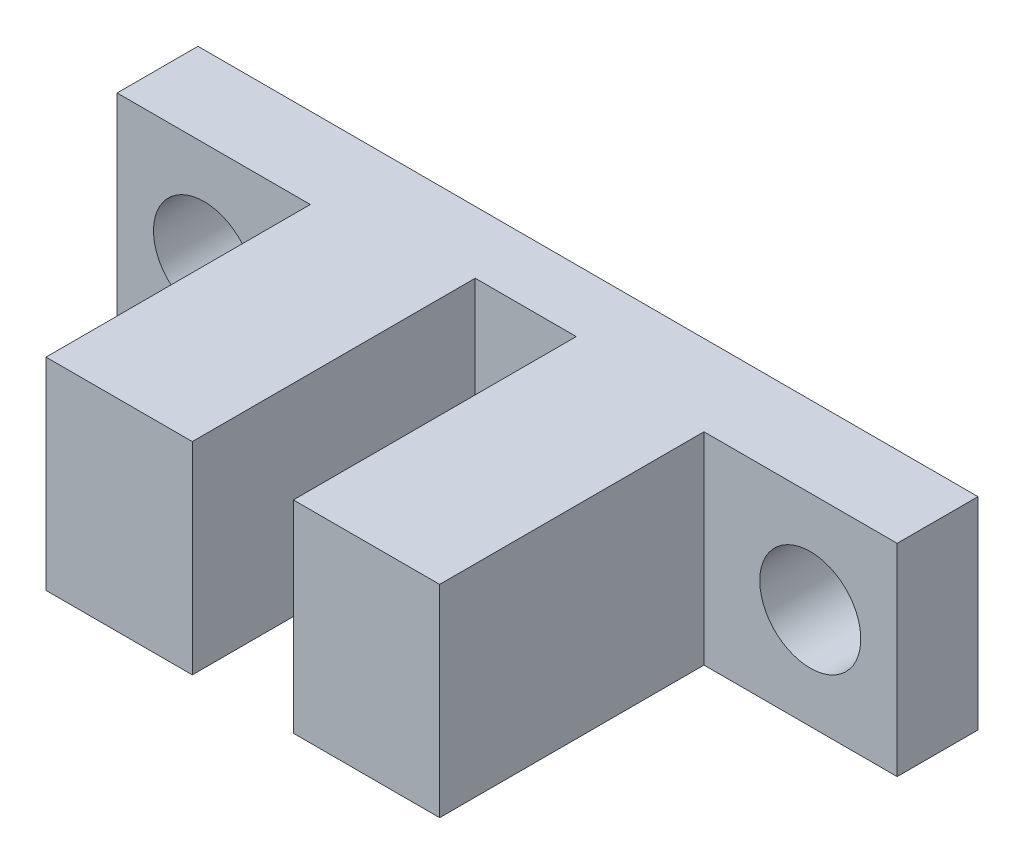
ISO-10303-21;
HEADER;
FILE_DESCRIPTION(('STEP AP214'),'2;1');
FILE_NAME('part.step','',(''),(''),'','','');
FILE_SCHEMA(('AUTOMOTIVE_DESIGN { 1 0 10303 214 1 1 1 1 }'));
ENDSEC;
DATA;
#1=APPLICATION_CONTEXT('core data for automotive mechanical design processes');
#2=APPLICATION_PROTOCOL_DEFINITION('international standard','automotive_design',2000,#1);
#3=PRODUCT_CONTEXT('',#1,'mechanical');
#4=PRODUCT('Part','Part','',(#3));
#5=PRODUCT_RELATED_PRODUCT_CATEGORY('part','',(#4));
#6=PRODUCT_DEFINITION_FORMATION('','',#4);
#7=PRODUCT_DEFINITION_CONTEXT('part definition',#1,'design');
#8=PRODUCT_DEFINITION('design','',#6,#7);
#9=PRODUCT_DEFINITION_SHAPE('','',#8);
#10=(LENGTH_UNIT() NAMED_UNIT(*) SI_UNIT(.MILLI.,.METRE.));
#11=(NAMED_UNIT(*) PLANE_ANGLE_UNIT() SI_UNIT($,.RADIAN.));
#12=(NAMED_UNIT(*) SI_UNIT($,.STERADIAN.) SOLID_ANGLE_UNIT());
#13=UNCERTAINTY_MEASURE_WITH_UNIT(LENGTH_MEASURE(1.E-05),#10,'distance_accuracy_value','');
#14=(GEOMETRIC_REPRESENTATION_CONTEXT(3) GLOBAL_UNCERTAINTY_ASSIGNED_CONTEXT((#13)) GLOBAL_UNIT_ASSIGNED_CONTEXT((#10,
#11,#12)) REPRESENTATION_CONTEXT('',''));
#15=CARTESIAN_POINT('',(0.,0.,0.));
#16=DIRECTION('',(0.,0.,1.));
#17=DIRECTION('',(1.,0.,0.));
#18=AXIS2_PLACEMENT_3D('',#15,#16,#17);
#19=CARTESIAN_POINT('',(0.,0.,10.8458));
#20=DIRECTION('',(0.,0.,-1.));
#21=DIRECTION('',(-1.,0.,0.));
#22=AXIS2_PLACEMENT_3D('',#19,#20,#21);
#23=PLANE('',#22);
#24=DIRECTION('',(-1.,0.,0.));
#25=VECTOR('',#24,1.);
#26=CARTESIAN_POINT('',(-6.1849,3.175,10.8458));
#27=LINE('',#26,#25);
#28=CARTESIAN_POINT('',(6.1849,3.175,10.8458));
#29=VERTEX_POINT('',#28);
#30=CARTESIAN_POINT('',(1.5875,3.175,10.8458));
#31=VERTEX_POINT('',#30);
#32=EDGE_CURVE('E166',#29,#31,#27,.T.);
#33=ORIENTED_EDGE('',*,*,#32,.T.);
#34=DIRECTION('',(0.,1.,0.));
#35=VECTOR('',#34,1.);
#36=CARTESIAN_POINT('',(1.5875,3.175,10.8458));
#37=LINE('',#36,#35);
#38=CARTESIAN_POINT('',(1.5875,-3.175,10.8458));
#39=VERTEX_POINT('',#38);
#40=EDGE_CURVE('E129',#39,#31,#37,.T.);
#41=ORIENTED_EDGE('',*,*,#40,.F.);
#42=DIRECTION('',(1.,0.,0.));
#43=VECTOR('',#42,1.);
#44=CARTESIAN_POINT('',(-6.1849,-3.175,10.8458));
#45=LINE('',#44,#43);
#46=CARTESIAN_POINT('',(6.1849,-3.175,10.8458));
#47=VERTEX_POINT('',#46);
#48=EDGE_CURVE('E170',#39,#47,#45,.T.);
#49=ORIENTED_EDGE('',*,*,#48,.T.);
#50=DIRECTION('',(0.,1.,0.));
#51=VECTOR('',#50,1.);
#52=CARTESIAN_POINT('',(6.1849,-3.175,10.8458));
#53=LINE('',#52,#51);
#54=EDGE_CURVE('E161',#47,#29,#53,.T.);
#55=ORIENTED_EDGE('',*,*,#54,.T.);
#56=EDGE_LOOP('',(#33,#41,#49,#55));
#57=FACE_BOUND('',#56,.T.);
#58=ADVANCED_FACE('F33',(#57),#23,.F.);
#59=CARTESIAN_POINT('',(0.,0.,2.54));
#60=DIRECTION('',(0.,0.,-1.));
#61=DIRECTION('',(-1.,0.,0.));
#62=AXIS2_PLACEMENT_3D('',#59,#60,#61);
#63=PLANE('',#62);
#64=CARTESIAN_POINT('',(9.525,0.,2.54));
#65=DIRECTION('',(0.,0.,-1.));
#66=DIRECTION('',(-1.,0.,0.));
#67=AXIS2_PLACEMENT_3D('',#64,#65,#66);
#68=CIRCLE('',#67,1.5875);
#69=CARTESIAN_POINT('',(7.9375,0.,2.54));
#70=VERTEX_POINT('',#69);
#71=EDGE_CURVE('E305',#70,#70,#68,.T.);
#72=ORIENTED_EDGE('',*,*,#71,.T.);
#73=EDGE_LOOP('',(#72));
#74=FACE_BOUND('',#73,.T.);
#75=DIRECTION('',(0.,1.,0.));
#76=VECTOR('',#75,1.);
#77=CARTESIAN_POINT('',(6.1849,-3.175,2.54));
#78=LINE('',#77,#76);
#79=CARTESIAN_POINT('',(6.1849,-3.175,2.54));
#80=VERTEX_POINT('',#79);
#81=CARTESIAN_POINT('',(6.1849,3.175,2.54));
#82=VERTEX_POINT('',#81);
#83=EDGE_CURVE('E58',#80,#82,#78,.T.);
#84=ORIENTED_EDGE('',*,*,#83,.F.);
#85=DIRECTION('',(1.,0.,0.));
#86=VECTOR('',#85,1.);
#87=CARTESIAN_POINT('',(-12.2555,-3.175,2.54));
#88=LINE('',#87,#86);
#89=CARTESIAN_POINT('',(12.2555,-3.175,2.54));
#90=VERTEX_POINT('',#89);
#91=EDGE_CURVE('E240',#80,#90,#88,.T.);
#92=ORIENTED_EDGE('',*,*,#91,.T.);
#93=DIRECTION('',(0.,1.,0.));
#94=VECTOR('',#93,1.);
#95=CARTESIAN_POINT('',(12.2555,-3.175,2.54));
#96=LINE('',#95,#94);
#97=CARTESIAN_POINT('',(12.2555,3.175,2.54));
#98=VERTEX_POINT('',#97);
#99=EDGE_CURVE('E223',#90,#98,#96,.T.);
#100=ORIENTED_EDGE('',*,*,#99,.T.);
#101=DIRECTION('',(-1.,0.,0.));
#102=VECTOR('',#101,1.);
#103=CARTESIAN_POINT('',(-12.2555,3.175,2.54));
#104=LINE('',#103,#102);
#105=EDGE_CURVE('E232',#98,#82,#104,.T.);
#106=ORIENTED_EDGE('',*,*,#105,.T.);
#107=EDGE_LOOP('',(#84,#92,#100,#106));
#108=FACE_BOUND('',#107,.T.);
#109=ADVANCED_FACE('F255',(#74,#108),#63,.F.);
#110=CARTESIAN_POINT('',(-9.525,0.,2.54));
#111=DIRECTION('',(0.,0.,-1.));
#112=DIRECTION('',(-1.,0.,0.));
#113=AXIS2_PLACEMENT_3D('',#110,#111,#112);
#114=CIRCLE('',#113,1.5875);
#115=CARTESIAN_POINT('',(-11.1125,0.,2.54));
#116=VERTEX_POINT('',#115);
#117=EDGE_CURVE('E153',#116,#116,#114,.T.);
#118=ORIENTED_EDGE('',*,*,#117,.T.);
#119=EDGE_LOOP('',(#118));
#120=FACE_BOUND('',#119,.T.);
#121=DIRECTION('',(0.,-1.,0.));
#122=VECTOR('',#121,1.);
#123=CARTESIAN_POINT('',(-6.1849,-3.175,2.54));
#124=LINE('',#123,#122);
#125=CARTESIAN_POINT('',(-6.1849,3.175,2.54));
#126=VERTEX_POINT('',#125);
#127=CARTESIAN_POINT('',(-6.1849,-3.175,2.54));
#128=VERTEX_POINT('',#127);
#129=EDGE_CURVE('E165',#126,#128,#124,.T.);
#130=ORIENTED_EDGE('',*,*,#129,.F.);
#131=CARTESIAN_POINT('',(-12.2555,3.175,2.54));
#132=VERTEX_POINT('',#131);
#133=EDGE_CURVE('E236',#126,#132,#104,.T.);
#134=ORIENTED_EDGE('',*,*,#133,.T.);
#135=DIRECTION('',(0.,-1.,0.));
#136=VECTOR('',#135,1.);
#137=CARTESIAN_POINT('',(-12.2555,-3.175,2.54));
#138=LINE('',#137,#136);
#139=CARTESIAN_POINT('',(-12.2555,-3.175,2.54));
#140=VERTEX_POINT('',#139);
#141=EDGE_CURVE('E235',#132,#140,#138,.T.);
#142=ORIENTED_EDGE('',*,*,#141,.T.);
#143=EDGE_CURVE('E227',#140,#128,#88,.T.);
#144=ORIENTED_EDGE('',*,*,#143,.T.);
#145=EDGE_LOOP('',(#130,#134,#142,#144));
#146=FACE_BOUND('',#145,.T.);
#147=ADVANCED_FACE('F247',(#120,#146),#63,.F.);
#148=CARTESIAN_POINT('',(12.2555,-3.175,2.54));
#149=DIRECTION('',(-1.,0.,0.));
#150=DIRECTION('',(0.,0.,1.));
#151=AXIS2_PLACEMENT_3D('',#148,#149,#150);
#152=PLANE('',#151);
#153=DIRECTION('',(0.,1.,0.));
#154=VECTOR('',#153,1.);
#155=CARTESIAN_POINT('',(12.2555,-3.175,0.));
#156=LINE('',#155,#154);
#157=CARTESIAN_POINT('',(12.2555,-3.175,0.));
#158=VERTEX_POINT('',#157);
#159=CARTESIAN_POINT('',(12.2555,3.175,0.));
#160=VERTEX_POINT('',#159);
#161=EDGE_CURVE('E205',#158,#160,#156,.T.);
#162=ORIENTED_EDGE('',*,*,#161,.T.);
#163=DIRECTION('',(0.,0.,-1.));
#164=VECTOR('',#163,1.);
#165=CARTESIAN_POINT('',(12.2555,3.175,2.54));
#166=LINE('',#165,#164);
#167=EDGE_CURVE('E11',#98,#160,#166,.T.);
#168=ORIENTED_EDGE('',*,*,#167,.F.);
#169=ORIENTED_EDGE('',*,*,#99,.F.);
#170=DIRECTION('',(0.,0.,-1.));
#171=VECTOR('',#170,1.);
#172=CARTESIAN_POINT('',(12.2555,-3.175,2.54));
#173=LINE('',#172,#171);
#174=EDGE_CURVE('E224',#90,#158,#173,.T.);
#175=ORIENTED_EDGE('',*,*,#174,.T.);
#176=EDGE_LOOP('',(#162,#168,#169,#175));
#177=FACE_BOUND('',#176,.T.);
#178=ADVANCED_FACE('F35',(#177),#152,.F.);
#179=CARTESIAN_POINT('',(-12.2555,3.175,2.54));
#180=DIRECTION('',(0.,-1.,0.));
#181=DIRECTION('',(0.,0.,-1.));
#182=AXIS2_PLACEMENT_3D('',#179,#180,#181);
#183=PLANE('',#182);
#184=DIRECTION('',(-1.,0.,0.));
#185=VECTOR('',#184,1.);
#186=CARTESIAN_POINT('',(-1.5875,3.175,1.9558));
#187=LINE('',#186,#185);
#188=CARTESIAN_POINT('',(1.5875,3.175,1.9558));
#189=VERTEX_POINT('',#188);
#190=CARTESIAN_POINT('',(-1.5875,3.175,1.9558));
#191=VERTEX_POINT('',#190);
#192=EDGE_CURVE('E139',#189,#191,#187,.T.);
#193=ORIENTED_EDGE('',*,*,#192,.F.);
#194=DIRECTION('',(0.,0.,1.));
#195=VECTOR('',#194,1.);
#196=CARTESIAN_POINT('',(1.5875,3.175,1.9558));
#197=LINE('',#196,#195);
#198=EDGE_CURVE('E123',#189,#31,#197,.T.);
#199=ORIENTED_EDGE('',*,*,#198,.T.);
#200=ORIENTED_EDGE('',*,*,#32,.F.);
#201=DIRECTION('',(0.,0.,-1.));
#202=VECTOR('',#201,1.);
#203=CARTESIAN_POINT('',(6.1849,3.175,10.8458));
#204=LINE('',#203,#202);
#205=EDGE_CURVE('E196',#29,#82,#204,.T.);
#206=ORIENTED_EDGE('',*,*,#205,.T.);
#207=ORIENTED_EDGE('',*,*,#105,.F.);
#208=ORIENTED_EDGE('',*,*,#167,.T.);
#209=DIRECTION('',(-1.,0.,0.));
#210=VECTOR('',#209,1.);
#211=CARTESIAN_POINT('',(-12.2555,3.175,0.));
#212=LINE('',#211,#210);
#213=CARTESIAN_POINT('',(-12.2555,3.175,0.));
#214=VERTEX_POINT('',#213);
#215=EDGE_CURVE('E208',#160,#214,#212,.T.);
#216=ORIENTED_EDGE('',*,*,#215,.T.);
#217=DIRECTION('',(0.,0.,-1.));
#218=VECTOR('',#217,1.);
#219=CARTESIAN_POINT('',(-12.2555,3.175,2.54));
#220=LINE('',#219,#218);
#221=EDGE_CURVE('E42',#132,#214,#220,.T.);
#222=ORIENTED_EDGE('',*,*,#221,.F.);
#223=ORIENTED_EDGE('',*,*,#133,.F.);
#224=DIRECTION('',(0.,0.,-1.));
#225=VECTOR('',#224,1.);
#226=CARTESIAN_POINT('',(-6.1849,3.175,10.8458));
#227=LINE('',#226,#225);
#228=CARTESIAN_POINT('',(-6.1849,3.175,10.8458));
#229=VERTEX_POINT('',#228);
#230=EDGE_CURVE('E189',#229,#126,#227,.T.);
#231=ORIENTED_EDGE('',*,*,#230,.F.);
#232=CARTESIAN_POINT('',(-1.5875,3.175,10.8458));
#233=VERTEX_POINT('',#232);
#234=EDGE_CURVE('E164',#233,#229,#27,.T.);
#235=ORIENTED_EDGE('',*,*,#234,.F.);
#236=DIRECTION('',(0.,0.,1.));
#237=VECTOR('',#236,1.);
#238=CARTESIAN_POINT('',(-1.5875,3.175,1.9558));
#239=LINE('',#238,#237);
#240=EDGE_CURVE('E50',#191,#233,#239,.T.);
#241=ORIENTED_EDGE('',*,*,#240,.F.);
#242=EDGE_LOOP('',(#193,#199,#200,#206,#207,#208,#216,#222,#223,#231,#235,#241));
#243=FACE_BOUND('',#242,.T.);
#244=ADVANCED_FACE('F144',(#243),#183,.F.);
#245=CARTESIAN_POINT('',(-12.2555,-3.175,2.54));
#246=DIRECTION('',(1.,0.,0.));
#247=DIRECTION('',(0.,0.,-1.));
#248=AXIS2_PLACEMENT_3D('',#245,#246,#247);
#249=PLANE('',#248);
#250=DIRECTION('',(0.,-1.,0.));
#251=VECTOR('',#250,1.);
#252=CARTESIAN_POINT('',(-12.2555,-3.175,0.));
#253=LINE('',#252,#251);
#254=CARTESIAN_POINT('',(-12.2555,-3.175,0.));
#255=VERTEX_POINT('',#254);
#256=EDGE_CURVE('E214',#214,#255,#253,.T.);
#257=ORIENTED_EDGE('',*,*,#256,.T.);
#258=DIRECTION('',(0.,0.,-1.));
#259=VECTOR('',#258,1.);
#260=CARTESIAN_POINT('',(-12.2555,-3.175,2.54));
#261=LINE('',#260,#259);
#262=EDGE_CURVE('E226',#140,#255,#261,.T.);
#263=ORIENTED_EDGE('',*,*,#262,.F.);
#264=ORIENTED_EDGE('',*,*,#141,.F.);
#265=ORIENTED_EDGE('',*,*,#221,.T.);
#266=EDGE_LOOP('',(#257,#263,#264,#265));
#267=FACE_BOUND('',#266,.T.);
#268=ADVANCED_FACE('F259',(#267),#249,.F.);
#269=CARTESIAN_POINT('',(-12.2555,-3.175,2.54));
#270=DIRECTION('',(0.,1.,0.));
#271=DIRECTION('',(0.,0.,1.));
#272=AXIS2_PLACEMENT_3D('',#269,#270,#271);
#273=PLANE('',#272);
#274=ORIENTED_EDGE('',*,*,#48,.F.);
#275=DIRECTION('',(0.,0.,1.));
#276=VECTOR('',#275,1.);
#277=CARTESIAN_POINT('',(1.5875,-3.175,1.9558));
#278=LINE('',#277,#276);
#279=CARTESIAN_POINT('',(1.5875,-3.175,1.9558));
#280=VERTEX_POINT('',#279);
#281=EDGE_CURVE('E155',#280,#39,#278,.T.);
#282=ORIENTED_EDGE('',*,*,#281,.F.);
#283=DIRECTION('',(1.,0.,0.));
#284=VECTOR('',#283,1.);
#285=CARTESIAN_POINT('',(-1.5875,-3.175,1.9558));
#286=LINE('',#285,#284);
#287=CARTESIAN_POINT('',(-1.5875,-3.175,1.9558));
#288=VERTEX_POINT('',#287);
#289=EDGE_CURVE('E133',#288,#280,#286,.T.);
#290=ORIENTED_EDGE('',*,*,#289,.F.);
#291=DIRECTION('',(0.,0.,1.));
#292=VECTOR('',#291,1.);
#293=CARTESIAN_POINT('',(-1.5875,-3.175,1.9558));
#294=LINE('',#293,#292);
#295=CARTESIAN_POINT('',(-1.5875,-3.175,10.8458));
#296=VERTEX_POINT('',#295);
#297=EDGE_CURVE('E157',#288,#296,#294,.T.);
#298=ORIENTED_EDGE('',*,*,#297,.T.);
#299=CARTESIAN_POINT('',(-6.1849,-3.175,10.8458));
#300=VERTEX_POINT('',#299);
#301=EDGE_CURVE('E171',#300,#296,#45,.T.);
#302=ORIENTED_EDGE('',*,*,#301,.F.);
#303=DIRECTION('',(0.,0.,-1.));
#304=VECTOR('',#303,1.);
#305=CARTESIAN_POINT('',(-6.1849,-3.175,10.8458));
#306=LINE('',#305,#304);
#307=EDGE_CURVE('E184',#300,#128,#306,.T.);
#308=ORIENTED_EDGE('',*,*,#307,.T.);
#309=ORIENTED_EDGE('',*,*,#143,.F.);
#310=ORIENTED_EDGE('',*,*,#262,.T.);
#311=DIRECTION('',(1.,0.,0.));
#312=VECTOR('',#311,1.);
#313=CARTESIAN_POINT('',(-12.2555,-3.175,0.));
#314=LINE('',#313,#312);
#315=EDGE_CURVE('E221',#255,#158,#314,.T.);
#316=ORIENTED_EDGE('',*,*,#315,.T.);
#317=ORIENTED_EDGE('',*,*,#174,.F.);
#318=ORIENTED_EDGE('',*,*,#91,.F.);
#319=DIRECTION('',(0.,0.,-1.));
#320=VECTOR('',#319,1.);
#321=CARTESIAN_POINT('',(6.1849,-3.175,10.8458));
#322=LINE('',#321,#320);
#323=EDGE_CURVE('E174',#47,#80,#322,.T.);
#324=ORIENTED_EDGE('',*,*,#323,.F.);
#325=EDGE_LOOP('',(#274,#282,#290,#298,#302,#308,#309,#310,#316,#317,#318,#324));
#326=FACE_BOUND('',#325,.T.);
#327=ADVANCED_FACE('F263',(#326),#273,.F.);
#328=CARTESIAN_POINT('',(0.,0.,0.));
#329=DIRECTION('',(0.,0.,-1.));
#330=DIRECTION('',(-1.,0.,0.));
#331=AXIS2_PLACEMENT_3D('',#328,#329,#330);
#332=PLANE('',#331);
#333=CARTESIAN_POINT('',(9.525,0.,0.));
#334=DIRECTION('',(0.,0.,-1.));
#335=DIRECTION('',(-1.,0.,0.));
#336=AXIS2_PLACEMENT_3D('',#333,#334,#335);
#337=CIRCLE('',#336,1.5875);
#338=CARTESIAN_POINT('',(7.9375,0.,0.));
#339=VERTEX_POINT('',#338);
#340=EDGE_CURVE('E302',#339,#339,#337,.T.);
#341=ORIENTED_EDGE('',*,*,#340,.F.);
#342=EDGE_LOOP('',(#341));
#343=FACE_BOUND('',#342,.T.);
#344=CARTESIAN_POINT('',(-9.525,0.,0.));
#345=DIRECTION('',(0.,0.,-1.));
#346=DIRECTION('',(-1.,0.,0.));
#347=AXIS2_PLACEMENT_3D('',#344,#345,#346);
#348=CIRCLE('',#347,1.5875);
#349=CARTESIAN_POINT('',(-11.1125,0.,0.));
#350=VERTEX_POINT('',#349);
#351=EDGE_CURVE('E306',#350,#350,#348,.T.);
#352=ORIENTED_EDGE('',*,*,#351,.F.);
#353=EDGE_LOOP('',(#352));
#354=FACE_BOUND('',#353,.T.);
#355=ORIENTED_EDGE('',*,*,#161,.F.);
#356=ORIENTED_EDGE('',*,*,#315,.F.);
#357=ORIENTED_EDGE('',*,*,#256,.F.);
#358=ORIENTED_EDGE('',*,*,#215,.F.);
#359=EDGE_LOOP('',(#355,#356,#357,#358));
#360=FACE_BOUND('',#359,.T.);
#361=ADVANCED_FACE('F261',(#343,#354,#360),#332,.T.);
#362=CARTESIAN_POINT('',(6.1849,-3.175,10.8458));
#363=DIRECTION('',(-1.,0.,0.));
#364=DIRECTION('',(0.,0.,1.));
#365=AXIS2_PLACEMENT_3D('',#362,#363,#364);
#366=PLANE('',#365);
#367=ORIENTED_EDGE('',*,*,#83,.T.);
#368=ORIENTED_EDGE('',*,*,#205,.F.);
#369=ORIENTED_EDGE('',*,*,#54,.F.);
#370=ORIENTED_EDGE('',*,*,#323,.T.);
#371=EDGE_LOOP('',(#367,#368,#369,#370));
#372=FACE_BOUND('',#371,.T.);
#373=ADVANCED_FACE('F264',(#372),#366,.F.);
#374=CARTESIAN_POINT('',(-6.1849,-3.175,10.8458));
#375=DIRECTION('',(1.,0.,0.));
#376=DIRECTION('',(0.,0.,-1.));
#377=AXIS2_PLACEMENT_3D('',#374,#375,#376);
#378=PLANE('',#377);
#379=ORIENTED_EDGE('',*,*,#129,.T.);
#380=ORIENTED_EDGE('',*,*,#307,.F.);
#381=DIRECTION('',(0.,-1.,0.));
#382=VECTOR('',#381,1.);
#383=CARTESIAN_POINT('',(-6.1849,-3.175,10.8458));
#384=LINE('',#383,#382);
#385=EDGE_CURVE('E168',#229,#300,#384,.T.);
#386=ORIENTED_EDGE('',*,*,#385,.F.);
#387=ORIENTED_EDGE('',*,*,#230,.T.);
#388=EDGE_LOOP('',(#379,#380,#386,#387));
#389=FACE_BOUND('',#388,.T.);
#390=ADVANCED_FACE('F250',(#389),#378,.F.);
#391=ORIENTED_EDGE('',*,*,#301,.T.);
#392=DIRECTION('',(0.,-1.,0.));
#393=VECTOR('',#392,1.);
#394=CARTESIAN_POINT('',(-1.5875,3.175,10.8458));
#395=LINE('',#394,#393);
#396=EDGE_CURVE('E142',#233,#296,#395,.T.);
#397=ORIENTED_EDGE('',*,*,#396,.F.);
#398=ORIENTED_EDGE('',*,*,#234,.T.);
#399=ORIENTED_EDGE('',*,*,#385,.T.);
#400=EDGE_LOOP('',(#391,#397,#398,#399));
#401=FACE_BOUND('',#400,.T.);
#402=ADVANCED_FACE('F268',(#401),#23,.F.);
#403=CARTESIAN_POINT('',(1.5875,3.175,1.9558));
#404=DIRECTION('',(1.,0.,0.));
#405=DIRECTION('',(0.,0.,-1.));
#406=AXIS2_PLACEMENT_3D('',#403,#404,#405);
#407=PLANE('',#406);
#408=ORIENTED_EDGE('',*,*,#40,.T.);
#409=ORIENTED_EDGE('',*,*,#198,.F.);
#410=DIRECTION('',(0.,1.,0.));
#411=VECTOR('',#410,1.);
#412=CARTESIAN_POINT('',(1.5875,3.175,1.9558));
#413=LINE('',#412,#411);
#414=EDGE_CURVE('E126',#280,#189,#413,.T.);
#415=ORIENTED_EDGE('',*,*,#414,.F.);
#416=ORIENTED_EDGE('',*,*,#281,.T.);
#417=EDGE_LOOP('',(#408,#409,#415,#416));
#418=FACE_BOUND('',#417,.T.);
#419=ADVANCED_FACE('F125',(#418),#407,.F.);
#420=CARTESIAN_POINT('',(-1.5875,3.175,1.9558));
#421=DIRECTION('',(-1.,0.,0.));
#422=DIRECTION('',(0.,0.,1.));
#423=AXIS2_PLACEMENT_3D('',#420,#421,#422);
#424=PLANE('',#423);
#425=ORIENTED_EDGE('',*,*,#396,.T.);
#426=ORIENTED_EDGE('',*,*,#297,.F.);
#427=DIRECTION('',(0.,-1.,0.));
#428=VECTOR('',#427,1.);
#429=CARTESIAN_POINT('',(-1.5875,3.175,1.9558));
#430=LINE('',#429,#428);
#431=EDGE_CURVE('E146',#191,#288,#430,.T.);
#432=ORIENTED_EDGE('',*,*,#431,.F.);
#433=ORIENTED_EDGE('',*,*,#240,.T.);
#434=EDGE_LOOP('',(#425,#426,#432,#433));
#435=FACE_BOUND('',#434,.T.);
#436=ADVANCED_FACE('F282',(#435),#424,.F.);
#437=CARTESIAN_POINT('',(0.,0.,1.9558));
#438=DIRECTION('',(0.,0.,1.));
#439=DIRECTION('',(1.,0.,0.));
#440=AXIS2_PLACEMENT_3D('',#437,#438,#439);
#441=PLANE('',#440);
#442=ORIENTED_EDGE('',*,*,#414,.T.);
#443=ORIENTED_EDGE('',*,*,#192,.T.);
#444=ORIENTED_EDGE('',*,*,#431,.T.);
#445=ORIENTED_EDGE('',*,*,#289,.T.);
#446=EDGE_LOOP('',(#442,#443,#444,#445));
#447=FACE_BOUND('',#446,.T.);
#448=ADVANCED_FACE('F137',(#447),#441,.T.);
#449=CARTESIAN_POINT('',(-9.525,0.,10.845825));
#450=DIRECTION('',(0.,0.,-1.));
#451=DIRECTION('',(-1.,0.,0.));
#452=AXIS2_PLACEMENT_3D('',#449,#450,#451);
#453=CYLINDRICAL_SURFACE('',#452,1.5875);
#454=ORIENTED_EDGE('',*,*,#351,.T.);
#455=EDGE_LOOP('',(#454));
#456=FACE_BOUND('',#455,.T.);
#457=ORIENTED_EDGE('',*,*,#117,.F.);
#458=EDGE_LOOP('',(#457));
#459=FACE_BOUND('',#458,.T.);
#460=ADVANCED_FACE('F288',(#456,#459),#453,.F.);
#461=CARTESIAN_POINT('',(9.525,0.,10.845825));
#462=DIRECTION('',(0.,0.,-1.));
#463=DIRECTION('',(-1.,0.,0.));
#464=AXIS2_PLACEMENT_3D('',#461,#462,#463);
#465=CYLINDRICAL_SURFACE('',#464,1.5875);
#466=ORIENTED_EDGE('',*,*,#340,.T.);
#467=EDGE_LOOP('',(#466));
#468=FACE_BOUND('',#467,.T.);
#469=ORIENTED_EDGE('',*,*,#71,.F.);
#470=EDGE_LOOP('',(#469));
#471=FACE_BOUND('',#470,.T.);
#472=ADVANCED_FACE('F293',(#468,#471),#465,.F.);
#473=CLOSED_SHELL('',(#58,#109,#147,#178,#244,#268,#327,#361,#373,#390,#402,#419,#436,#448,#460,#472));
#474=MANIFOLD_SOLID_BREP('B2',#473);
#475=ADVANCED_BREP_SHAPE_REPRESENTATION('',(#18,#474),#14);
#476=SHAPE_DEFINITION_REPRESENTATION(#9,#475);
ENDSEC;
END-ISO-10303-21;
